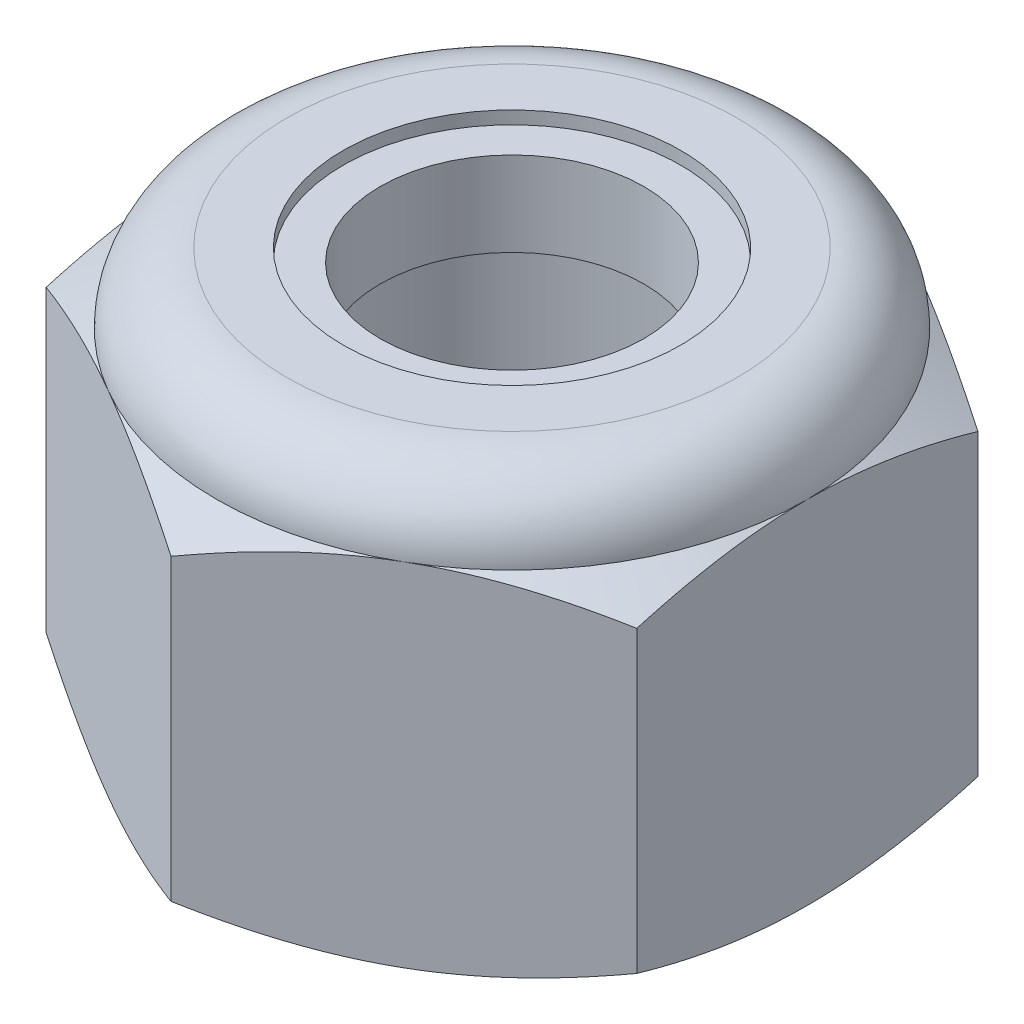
from build123d import *

# Parameters (mm, degrees)
EXTRUDE1_DEPTH      = 5
SKETCH7_R           = 2
CUT_EXTRUDE4_DEPTH  = 8.320063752
CUT_EXTRUDE5_START  = -0.833333
SKETCH13_OUTSIDE_W  = 37.296
SKETCH13_OUTSIDE_H  = 38.378
SKETCH13_OUTSIDE_R  = 3.5
CUT_EXTRUDE5_DEPTH  = 7.486730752
CUT_EXTRUDE5_DRAFT  = -60
SKETCH19_OUTSIDE_W  = 40.182
SKETCH19_OUTSIDE_H  = 41.264
SKETCH19_OUTSIDE_R  = 3.5
CUT_EXTRUDE6_DEPTH  = 8.320063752
CUT_EXTRUDE6_DRAFT  = -60
BOSS_EXTRUDE1_START = -0.1524
SKETCH20_R          = 2
SKETCH20_R_2        = 1.5625
BOSS_EXTRUDE1_DEPTH = 1


with BuildPart() as part:
    # Sketch1 → Extrude1 (new body)
    with BuildSketch(Plane(origin=(0, 0, 0), x_dir=(1, 0, 0), z_dir=(0, 1, 0))):
        Polygon((0, 4.041451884), (-3.5, 2.020725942), (-3.5, -2.020725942), (0, -4.041451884), (3.5, -2.020725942), (3.5, 2.020725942), align=None)
    extrude(amount=EXTRUDE1_DEPTH)

    # Sketch7 → Cut-Extrude4 (cut, through all)
    with BuildSketch(Plane(origin=(0, 0, 0), x_dir=(1, 0, 0), z_dir=(0, 1, 0))):
        with Locations(Location((0, 0, 0), (0, 0, 270))):
            Circle(SKETCH7_R)
    extrude(amount=CUT_EXTRUDE4_DEPTH, mode=Mode.SUBTRACT)

    # Sketch18 → Cut-Revolve1 (revolve, cut)
    with BuildSketch(Plane(origin=(0, 0, 0), x_dir=(0, 0, -1), z_dir=(1, 0, 0)), mode=Mode.PRIVATE) as cut_revolve1_sk:
        with BuildLine():
            Line((3.5, 4.166666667), (4.041451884, 4.166666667))
            Line((4.041451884, 4.166666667), (4.041451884, 5))
            Line((4.041451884, 5), (2.666666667, 5))
            ThreePointArc((2.666666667, 5), (3.255922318, 4.755922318), (3.5, 4.166666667))
        make_face()
    revolve(cut_revolve1_sk.sketch.rotate(Axis((0, 5, 0), (0, -1, 0)), 180), axis=Axis((0, 5, 0), (0, -1, 0)), mode=Mode.SUBTRACT)


with BuildPart() as cut_extrude5_tool:
    # Sketch13 outside → Cut-Extrude5 (with draft: the straight prism first)
    with BuildSketch(Plane(origin=(0, 5, 0), x_dir=(1, 0, 0), z_dir=(0, 1, 0)).offset(CUT_EXTRUDE5_START)):
        Rectangle(SKETCH13_OUTSIDE_W, SKETCH13_OUTSIDE_H)
        Circle(SKETCH13_OUTSIDE_R, mode=Mode.SUBTRACT)
    extrude(amount=-CUT_EXTRUDE5_DEPTH)
    # Cut-Extrude5: the draft: its side faces are tilted about the plane it starts from
    cut_extrude5_sides = [cut_extrude5_tool.faces().sort_by_distance(p)[0] for p in [
        (0, 0.423301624, 19.189),
        (18.648, 0.423301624, 0),
        (0, 0.423301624, -19.189),
        (-18.648, 0.423301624, 0),
        (-3.5, 0.423301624, 0),
    ]]
    draft(cut_extrude5_sides, Plane(origin=(0, 5, 0), x_dir=(1, 0, 0), z_dir=(0, 1, 0)).offset(CUT_EXTRUDE5_START), CUT_EXTRUDE5_DRAFT)


with BuildPart() as part_1:
    add(part.part)

    # Cut-Extrude5: cut by cut_extrude5_tool
    add(cut_extrude5_tool.part, mode=Mode.SUBTRACT)


with BuildPart() as cut_extrude6_tool:
    # Sketch19 outside → Cut-Extrude6 (with draft: the straight prism first)
    with BuildSketch(Plane.XZ):
        Rectangle(SKETCH19_OUTSIDE_W, SKETCH19_OUTSIDE_H)
        Circle(SKETCH19_OUTSIDE_R, mode=Mode.SUBTRACT)
    extrude(amount=-CUT_EXTRUDE6_DEPTH)
    # Cut-Extrude6: the draft: its side faces are tilted about the plane it starts from
    cut_extrude6_sides = [cut_extrude6_tool.faces().sort_by_distance(p)[0] for p in [
        (0, 4.160031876, -20.632),
        (20.091, 4.160031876, 0),
        (0, 4.160031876, 20.632),
        (-20.091, 4.160031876, 0),
        (-3.5, 4.160031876, 0),
    ]]
    draft(cut_extrude6_sides, Plane.XZ, CUT_EXTRUDE6_DRAFT)


with BuildPart() as part_2:
    add(part_1.part)

    # Cut-Extrude6: cut by cut_extrude6_tool
    add(cut_extrude6_tool.part, mode=Mode.SUBTRACT)


with BuildPart() as body_2:
    # Sketch20 → Boss-Extrude1 (new body)
    with BuildSketch(Plane(origin=(0, 5, 0), x_dir=(1, 0, 0), z_dir=(0, 1, 0)).offset(BOSS_EXTRUDE1_START)):
        with Locations(Location((0, 0, 0), (0, 0, 270))):
            Circle(SKETCH20_R)
        with Locations(Location((0, 0, 0), (0, 0, 270))):
            Circle(SKETCH20_R_2, mode=Mode.SUBTRACT)
    extrude(amount=-BOSS_EXTRUDE1_DEPTH)


solid = Compound([part_2.part, body_2.part])
